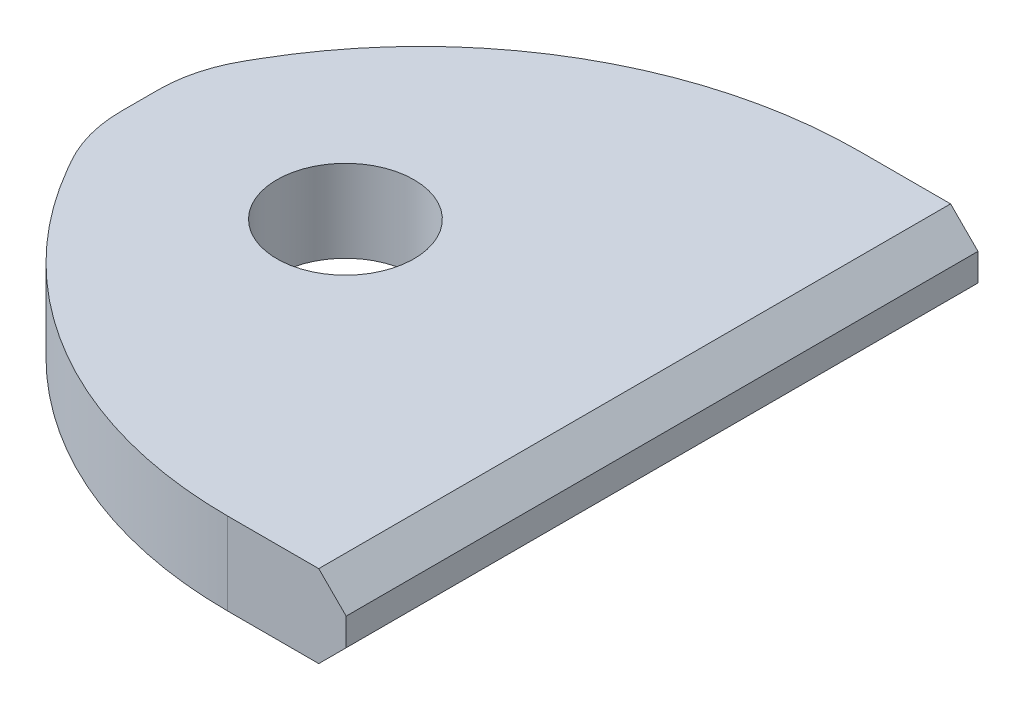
ISO-10303-21;
HEADER;
FILE_DESCRIPTION(('STEP AP214'),'2;1');
FILE_NAME('part.step','',(''),(''),'','','');
FILE_SCHEMA(('AUTOMOTIVE_DESIGN { 1 0 10303 214 1 1 1 1 }'));
ENDSEC;
DATA;
#1=APPLICATION_CONTEXT('core data for automotive mechanical design processes');
#2=APPLICATION_PROTOCOL_DEFINITION('international standard','automotive_design',2000,#1);
#3=PRODUCT_CONTEXT('',#1,'mechanical');
#4=PRODUCT('Part','Part','',(#3));
#5=PRODUCT_RELATED_PRODUCT_CATEGORY('part','',(#4));
#6=PRODUCT_DEFINITION_FORMATION('','',#4);
#7=PRODUCT_DEFINITION_CONTEXT('part definition',#1,'design');
#8=PRODUCT_DEFINITION('design','',#6,#7);
#9=PRODUCT_DEFINITION_SHAPE('','',#8);
#10=(LENGTH_UNIT() NAMED_UNIT(*) SI_UNIT(.MILLI.,.METRE.));
#11=(NAMED_UNIT(*) PLANE_ANGLE_UNIT() SI_UNIT($,.RADIAN.));
#12=(NAMED_UNIT(*) SI_UNIT($,.STERADIAN.) SOLID_ANGLE_UNIT());
#13=UNCERTAINTY_MEASURE_WITH_UNIT(LENGTH_MEASURE(1.E-05),#10,'distance_accuracy_value','');
#14=(GEOMETRIC_REPRESENTATION_CONTEXT(3) GLOBAL_UNCERTAINTY_ASSIGNED_CONTEXT((#13)) GLOBAL_UNIT_ASSIGNED_CONTEXT((#10,
#11,#12)) REPRESENTATION_CONTEXT('',''));
#15=CARTESIAN_POINT('',(0.,0.,0.));
#16=DIRECTION('',(0.,0.,1.));
#17=DIRECTION('',(1.,0.,0.));
#18=AXIS2_PLACEMENT_3D('',#15,#16,#17);
#19=CARTESIAN_POINT('',(22.9502505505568,4.7625,-14.224));
#20=DIRECTION('',(0.,-1.,0.));
#21=DIRECTION('',(0.,0.,-1.));
#22=AXIS2_PLACEMENT_3D('',#19,#20,#21);
#23=PLANE('',#22);
#24=DIRECTION('',(1.,0.,0.));
#25=VECTOR('',#24,1.);
#26=CARTESIAN_POINT('',(36.66109,4.7625,36.576));
#27=LINE('',#26,#25);
#28=CARTESIAN_POINT('',(22.9502505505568,4.7625,36.576));
#29=VERTEX_POINT('',#28);
#30=CARTESIAN_POINT('',(33.48609,4.7625,36.576));
#31=VERTEX_POINT('',#30);
#32=EDGE_CURVE('E193',#29,#31,#27,.T.);
#33=ORIENTED_EDGE('',*,*,#32,.T.);
#34=DIRECTION('',(0.,0.,-1.));
#35=VECTOR('',#34,1.);
#36=CARTESIAN_POINT('',(33.48609,4.7625,-14.224));
#37=LINE('',#36,#35);
#38=CARTESIAN_POINT('',(33.48609,4.7625,-36.576));
#39=VERTEX_POINT('',#38);
#40=EDGE_CURVE('E11',#31,#39,#37,.T.);
#41=ORIENTED_EDGE('',*,*,#40,.T.);
#42=DIRECTION('',(-1.,0.,0.));
#43=VECTOR('',#42,1.);
#44=CARTESIAN_POINT('',(22.9502505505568,4.7625,-36.576));
#45=LINE('',#44,#43);
#46=CARTESIAN_POINT('',(22.9502505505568,4.7625,-36.576));
#47=VERTEX_POINT('',#46);
#48=EDGE_CURVE('E128',#39,#47,#45,.T.);
#49=ORIENTED_EDGE('',*,*,#48,.T.);
#50=CARTESIAN_POINT('',(22.9502505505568,4.7625,14.224));
#51=DIRECTION('',(0.,1.,0.));
#52=DIRECTION('',(0.,0.,1.));
#53=AXIS2_PLACEMENT_3D('',#50,#51,#52);
#54=CIRCLE('',#53,50.8);
#55=CARTESIAN_POINT('',(-21.0438399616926,4.7625,-11.176));
#56=VERTEX_POINT('',#55);
#57=EDGE_CURVE('E131',#47,#56,#54,.T.);
#58=ORIENTED_EDGE('',*,*,#57,.T.);
#59=DIRECTION('',(-0.500000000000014,0.,0.86602540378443));
#60=VECTOR('',#59,1.);
#61=CARTESIAN_POINT('',(-21.6856532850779,4.7625,-10.0643467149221));
#62=LINE('',#61,#60);
#63=CARTESIAN_POINT('',(-21.6856532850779,4.7625,-10.0643467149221));
#64=VERTEX_POINT('',#63);
#65=EDGE_CURVE('E145',#56,#64,#62,.T.);
#66=ORIENTED_EDGE('',*,*,#65,.T.);
#67=CARTESIAN_POINT('',(-7.9375,4.7625,-2.12684671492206));
#68=DIRECTION('',(0.,1.,0.));
#69=DIRECTION('',(0.,0.,-1.));
#70=AXIS2_PLACEMENT_3D('',#67,#68,#69);
#71=CIRCLE('',#70,15.875);
#72=CARTESIAN_POINT('',(-23.8125,4.7625,-2.126846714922));
#73=VERTEX_POINT('',#72);
#74=EDGE_CURVE('E228',#64,#73,#71,.T.);
#75=ORIENTED_EDGE('',*,*,#74,.T.);
#76=DIRECTION('',(0.,0.,1.));
#77=VECTOR('',#76,1.);
#78=CARTESIAN_POINT('',(-23.8125,4.7625,2.12684671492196));
#79=LINE('',#78,#77);
#80=CARTESIAN_POINT('',(-23.8125,4.7625,2.12684671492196));
#81=VERTEX_POINT('',#80);
#82=EDGE_CURVE('E244',#73,#81,#79,.T.);
#83=ORIENTED_EDGE('',*,*,#82,.T.);
#84=CARTESIAN_POINT('',(-7.9375,4.7625,2.12684671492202));
#85=DIRECTION('',(0.,1.,0.));
#86=DIRECTION('',(0.,0.,1.));
#87=AXIS2_PLACEMENT_3D('',#84,#85,#86);
#88=CIRCLE('',#87,15.875);
#89=CARTESIAN_POINT('',(-21.685653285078,4.7625,10.064346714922));
#90=VERTEX_POINT('',#89);
#91=EDGE_CURVE('E241',#81,#90,#88,.T.);
#92=ORIENTED_EDGE('',*,*,#91,.T.);
#93=DIRECTION('',(0.500000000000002,0.,0.866025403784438));
#94=VECTOR('',#93,1.);
#95=CARTESIAN_POINT('',(-21.685653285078,4.7625,10.064346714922));
#96=LINE('',#95,#94);
#97=CARTESIAN_POINT('',(-21.0438399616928,4.7625,11.1759999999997));
#98=VERTEX_POINT('',#97);
#99=EDGE_CURVE('E243',#90,#98,#96,.T.);
#100=ORIENTED_EDGE('',*,*,#99,.T.);
#101=CARTESIAN_POINT('',(22.9502505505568,4.7625,-14.224));
#102=DIRECTION('',(0.,1.,0.));
#103=DIRECTION('',(0.,0.,-1.));
#104=AXIS2_PLACEMENT_3D('',#101,#102,#103);
#105=CIRCLE('',#104,50.8);
#106=EDGE_CURVE('E246',#98,#29,#105,.T.);
#107=ORIENTED_EDGE('',*,*,#106,.T.);
#108=EDGE_LOOP('',(#33,#41,#49,#58,#66,#75,#83,#92,#100,#107));
#109=FACE_BOUND('',#108,.T.);
#110=CARTESIAN_POINT('',(0.,4.7625,0.));
#111=DIRECTION('',(0.,1.,0.));
#112=DIRECTION('',(0.,0.,1.));
#113=AXIS2_PLACEMENT_3D('',#110,#111,#112);
#114=CIRCLE('',#113,7.9375);
#115=CARTESIAN_POINT('',(0.,4.7625,-7.9375));
#116=VERTEX_POINT('',#115);
#117=EDGE_CURVE('E185',#116,#116,#114,.T.);
#118=ORIENTED_EDGE('',*,*,#117,.F.);
#119=EDGE_LOOP('',(#118));
#120=FACE_BOUND('',#119,.T.);
#121=ADVANCED_FACE('F35',(#109,#120),#23,.F.);
#122=CARTESIAN_POINT('',(22.9502505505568,-4.7625,-14.224));
#123=DIRECTION('',(0.,-1.,0.));
#124=DIRECTION('',(0.,0.,-1.));
#125=AXIS2_PLACEMENT_3D('',#122,#123,#124);
#126=PLANE('',#125);
#127=DIRECTION('',(-1.,0.,0.));
#128=VECTOR('',#127,1.);
#129=CARTESIAN_POINT('',(22.9502505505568,-4.7625,-36.576));
#130=LINE('',#129,#128);
#131=CARTESIAN_POINT('',(33.48609,-4.7625,-36.576));
#132=VERTEX_POINT('',#131);
#133=CARTESIAN_POINT('',(22.9502505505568,-4.7625,-36.576));
#134=VERTEX_POINT('',#133);
#135=EDGE_CURVE('E149',#132,#134,#130,.T.);
#136=ORIENTED_EDGE('',*,*,#135,.F.);
#137=DIRECTION('',(0.,0.,1.));
#138=VECTOR('',#137,1.);
#139=CARTESIAN_POINT('',(33.48609,-4.7625,36.576));
#140=LINE('',#139,#138);
#141=CARTESIAN_POINT('',(33.48609,-4.7625,36.576));
#142=VERTEX_POINT('',#141);
#143=EDGE_CURVE('E59',#132,#142,#140,.T.);
#144=ORIENTED_EDGE('',*,*,#143,.T.);
#145=DIRECTION('',(1.,0.,0.));
#146=VECTOR('',#145,1.);
#147=CARTESIAN_POINT('',(36.66109,-4.7625,36.576));
#148=LINE('',#147,#146);
#149=CARTESIAN_POINT('',(22.9502505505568,-4.7625,36.576));
#150=VERTEX_POINT('',#149);
#151=EDGE_CURVE('E136',#150,#142,#148,.T.);
#152=ORIENTED_EDGE('',*,*,#151,.F.);
#153=CARTESIAN_POINT('',(22.9502505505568,-4.7625,-14.224));
#154=DIRECTION('',(0.,1.,0.));
#155=DIRECTION('',(0.,0.,-1.));
#156=AXIS2_PLACEMENT_3D('',#153,#154,#155);
#157=CIRCLE('',#156,50.8);
#158=CARTESIAN_POINT('',(-21.0438399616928,-4.7625,11.1759999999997));
#159=VERTEX_POINT('',#158);
#160=EDGE_CURVE('E205',#159,#150,#157,.T.);
#161=ORIENTED_EDGE('',*,*,#160,.F.);
#162=DIRECTION('',(0.500000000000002,0.,0.866025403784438));
#163=VECTOR('',#162,1.);
#164=CARTESIAN_POINT('',(-21.685653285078,-4.7625,10.064346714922));
#165=LINE('',#164,#163);
#166=CARTESIAN_POINT('',(-21.685653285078,-4.7625,10.064346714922));
#167=VERTEX_POINT('',#166);
#168=EDGE_CURVE('E203',#167,#159,#165,.T.);
#169=ORIENTED_EDGE('',*,*,#168,.F.);
#170=CARTESIAN_POINT('',(-7.9375,-4.7625,2.12684671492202));
#171=DIRECTION('',(0.,1.,0.));
#172=DIRECTION('',(0.,0.,1.));
#173=AXIS2_PLACEMENT_3D('',#170,#171,#172);
#174=CIRCLE('',#173,15.875);
#175=CARTESIAN_POINT('',(-23.8125,-4.7625,2.12684671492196));
#176=VERTEX_POINT('',#175);
#177=EDGE_CURVE('E201',#176,#167,#174,.T.);
#178=ORIENTED_EDGE('',*,*,#177,.F.);
#179=DIRECTION('',(0.,0.,1.));
#180=VECTOR('',#179,1.);
#181=CARTESIAN_POINT('',(-23.8125,-4.7625,2.12684671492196));
#182=LINE('',#181,#180);
#183=CARTESIAN_POINT('',(-23.8125,-4.7625,-2.126846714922));
#184=VERTEX_POINT('',#183);
#185=EDGE_CURVE('E199',#184,#176,#182,.T.);
#186=ORIENTED_EDGE('',*,*,#185,.F.);
#187=CARTESIAN_POINT('',(-7.9375,-4.7625,-2.12684671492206));
#188=DIRECTION('',(0.,1.,0.));
#189=DIRECTION('',(0.,0.,-1.));
#190=AXIS2_PLACEMENT_3D('',#187,#188,#189);
#191=CIRCLE('',#190,15.875);
#192=CARTESIAN_POINT('',(-21.6856532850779,-4.7625,-10.0643467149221));
#193=VERTEX_POINT('',#192);
#194=EDGE_CURVE('E197',#193,#184,#191,.T.);
#195=ORIENTED_EDGE('',*,*,#194,.F.);
#196=DIRECTION('',(-0.500000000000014,0.,0.86602540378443));
#197=VECTOR('',#196,1.);
#198=CARTESIAN_POINT('',(-21.6856532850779,-4.7625,-10.0643467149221));
#199=LINE('',#198,#197);
#200=CARTESIAN_POINT('',(-21.0438399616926,-4.7625,-11.176));
#201=VERTEX_POINT('',#200);
#202=EDGE_CURVE('E187',#201,#193,#199,.T.);
#203=ORIENTED_EDGE('',*,*,#202,.F.);
#204=CARTESIAN_POINT('',(22.9502505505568,-4.7625,14.224));
#205=DIRECTION('',(0.,1.,0.));
#206=DIRECTION('',(0.,0.,1.));
#207=AXIS2_PLACEMENT_3D('',#204,#205,#206);
#208=CIRCLE('',#207,50.8);
#209=EDGE_CURVE('E184',#134,#201,#208,.T.);
#210=ORIENTED_EDGE('',*,*,#209,.F.);
#211=EDGE_LOOP('',(#136,#144,#152,#161,#169,#178,#186,#195,#203,#210));
#212=FACE_BOUND('',#211,.T.);
#213=CARTESIAN_POINT('',(0.,-4.7625,0.));
#214=DIRECTION('',(0.,1.,0.));
#215=DIRECTION('',(0.,0.,1.));
#216=AXIS2_PLACEMENT_3D('',#213,#214,#215);
#217=CIRCLE('',#216,7.9375);
#218=CARTESIAN_POINT('',(0.,-4.7625,-7.9375));
#219=VERTEX_POINT('',#218);
#220=EDGE_CURVE('E190',#219,#219,#217,.T.);
#221=ORIENTED_EDGE('',*,*,#220,.T.);
#222=EDGE_LOOP('',(#221));
#223=FACE_BOUND('',#222,.T.);
#224=ADVANCED_FACE('F181',(#212,#223),#126,.T.);
#225=CARTESIAN_POINT('',(22.9502505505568,4.7625,-36.576));
#226=DIRECTION('',(0.,0.,1.));
#227=DIRECTION('',(1.,0.,0.));
#228=AXIS2_PLACEMENT_3D('',#225,#226,#227);
#229=PLANE('',#228);
#230=DIRECTION('',(0.,-1.,0.));
#231=VECTOR('',#230,1.);
#232=CARTESIAN_POINT('',(36.66109,4.7625,-36.576));
#233=LINE('',#232,#231);
#234=CARTESIAN_POINT('',(36.66109,1.58749999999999,-36.576));
#235=VERTEX_POINT('',#234);
#236=CARTESIAN_POINT('',(36.66109,-1.5875,-36.576));
#237=VERTEX_POINT('',#236);
#238=EDGE_CURVE('E178',#235,#237,#233,.T.);
#239=ORIENTED_EDGE('',*,*,#238,.T.);
#240=DIRECTION('',(-0.707106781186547,-0.707106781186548,0.));
#241=VECTOR('',#240,1.);
#242=CARTESIAN_POINT('',(36.66109,-1.5875,-36.576));
#243=LINE('',#242,#241);
#244=EDGE_CURVE('E163',#237,#132,#243,.T.);
#245=ORIENTED_EDGE('',*,*,#244,.T.);
#246=ORIENTED_EDGE('',*,*,#135,.T.);
#247=DIRECTION('',(0.,-1.,0.));
#248=VECTOR('',#247,1.);
#249=CARTESIAN_POINT('',(22.9502505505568,4.7625,-36.576));
#250=LINE('',#249,#248);
#251=EDGE_CURVE('E141',#47,#134,#250,.T.);
#252=ORIENTED_EDGE('',*,*,#251,.F.);
#253=ORIENTED_EDGE('',*,*,#48,.F.);
#254=DIRECTION('',(-0.707106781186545,0.70710678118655,0.));
#255=VECTOR('',#254,1.);
#256=CARTESIAN_POINT('',(33.48609,4.7625,-36.576));
#257=LINE('',#256,#255);
#258=EDGE_CURVE('E161',#39,#235,#257,.F.);
#259=ORIENTED_EDGE('',*,*,#258,.T.);
#260=EDGE_LOOP('',(#239,#245,#246,#252,#253,#259));
#261=FACE_BOUND('',#260,.T.);
#262=ADVANCED_FACE('F148',(#261),#229,.F.);
#263=CARTESIAN_POINT('',(22.9502505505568,4.7625,14.224));
#264=DIRECTION('',(0.,-1.,0.));
#265=DIRECTION('',(0.,0.,-1.));
#266=AXIS2_PLACEMENT_3D('',#263,#264,#265);
#267=CYLINDRICAL_SURFACE('',#266,50.8);
#268=ORIENTED_EDGE('',*,*,#209,.T.);
#269=DIRECTION('',(0.,-1.,0.));
#270=VECTOR('',#269,1.);
#271=CARTESIAN_POINT('',(-21.0438399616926,4.7625,-11.176));
#272=LINE('',#271,#270);
#273=EDGE_CURVE('E143',#56,#201,#272,.T.);
#274=ORIENTED_EDGE('',*,*,#273,.F.);
#275=ORIENTED_EDGE('',*,*,#57,.F.);
#276=ORIENTED_EDGE('',*,*,#251,.T.);
#277=EDGE_LOOP('',(#268,#274,#275,#276));
#278=FACE_BOUND('',#277,.T.);
#279=ADVANCED_FACE('F140',(#278),#267,.T.);
#280=CARTESIAN_POINT('',(-21.6856532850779,4.7625,-10.0643467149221));
#281=DIRECTION('',(0.86602540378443,0.,0.500000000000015));
#282=DIRECTION('',(0.500000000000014,0.,-0.86602540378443));
#283=AXIS2_PLACEMENT_3D('',#280,#281,#282);
#284=PLANE('',#283);
#285=ORIENTED_EDGE('',*,*,#202,.T.);
#286=DIRECTION('',(0.,-1.,0.));
#287=VECTOR('',#286,1.);
#288=CARTESIAN_POINT('',(-21.6856532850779,4.7625,-10.0643467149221));
#289=LINE('',#288,#287);
#290=EDGE_CURVE('E155',#64,#193,#289,.T.);
#291=ORIENTED_EDGE('',*,*,#290,.F.);
#292=ORIENTED_EDGE('',*,*,#65,.F.);
#293=ORIENTED_EDGE('',*,*,#273,.T.);
#294=EDGE_LOOP('',(#285,#291,#292,#293));
#295=FACE_BOUND('',#294,.T.);
#296=ADVANCED_FACE('F284',(#295),#284,.F.);
#297=CARTESIAN_POINT('',(-7.9375,4.7625,-2.12684671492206));
#298=DIRECTION('',(0.,-1.,0.));
#299=DIRECTION('',(0.,0.,-1.));
#300=AXIS2_PLACEMENT_3D('',#297,#298,#299);
#301=CYLINDRICAL_SURFACE('',#300,15.875);
#302=ORIENTED_EDGE('',*,*,#194,.T.);
#303=DIRECTION('',(0.,-1.,0.));
#304=VECTOR('',#303,1.);
#305=CARTESIAN_POINT('',(-23.8125,4.7625,-2.126846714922));
#306=LINE('',#305,#304);
#307=EDGE_CURVE('E219',#73,#184,#306,.T.);
#308=ORIENTED_EDGE('',*,*,#307,.F.);
#309=ORIENTED_EDGE('',*,*,#74,.F.);
#310=ORIENTED_EDGE('',*,*,#290,.T.);
#311=EDGE_LOOP('',(#302,#308,#309,#310));
#312=FACE_BOUND('',#311,.T.);
#313=ADVANCED_FACE('F226',(#312),#301,.T.);
#314=CARTESIAN_POINT('',(-23.8125,4.7625,2.12684671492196));
#315=DIRECTION('',(1.,0.,0.));
#316=DIRECTION('',(0.,0.,-1.));
#317=AXIS2_PLACEMENT_3D('',#314,#315,#316);
#318=PLANE('',#317);
#319=ORIENTED_EDGE('',*,*,#185,.T.);
#320=DIRECTION('',(0.,-1.,0.));
#321=VECTOR('',#320,1.);
#322=CARTESIAN_POINT('',(-23.8125,4.7625,2.12684671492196));
#323=LINE('',#322,#321);
#324=EDGE_CURVE('E216',#81,#176,#323,.T.);
#325=ORIENTED_EDGE('',*,*,#324,.F.);
#326=ORIENTED_EDGE('',*,*,#82,.F.);
#327=ORIENTED_EDGE('',*,*,#307,.T.);
#328=EDGE_LOOP('',(#319,#325,#326,#327));
#329=FACE_BOUND('',#328,.T.);
#330=ADVANCED_FACE('F235',(#329),#318,.F.);
#331=CARTESIAN_POINT('',(-7.9375,4.7625,2.12684671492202));
#332=DIRECTION('',(0.,-1.,0.));
#333=DIRECTION('',(0.,0.,-1.));
#334=AXIS2_PLACEMENT_3D('',#331,#332,#333);
#335=CYLINDRICAL_SURFACE('',#334,15.875);
#336=ORIENTED_EDGE('',*,*,#177,.T.);
#337=DIRECTION('',(0.,-1.,0.));
#338=VECTOR('',#337,1.);
#339=CARTESIAN_POINT('',(-21.685653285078,4.7625,10.064346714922));
#340=LINE('',#339,#338);
#341=EDGE_CURVE('E213',#90,#167,#340,.T.);
#342=ORIENTED_EDGE('',*,*,#341,.F.);
#343=ORIENTED_EDGE('',*,*,#91,.F.);
#344=ORIENTED_EDGE('',*,*,#324,.T.);
#345=EDGE_LOOP('',(#336,#342,#343,#344));
#346=FACE_BOUND('',#345,.T.);
#347=ADVANCED_FACE('F239',(#346),#335,.T.);
#348=CARTESIAN_POINT('',(-21.685653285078,4.7625,10.064346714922));
#349=DIRECTION('',(0.866025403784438,0.,-0.500000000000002));
#350=DIRECTION('',(-0.500000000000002,0.,-0.866025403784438));
#351=AXIS2_PLACEMENT_3D('',#348,#349,#350);
#352=PLANE('',#351);
#353=ORIENTED_EDGE('',*,*,#168,.T.);
#354=DIRECTION('',(0.,-1.,0.));
#355=VECTOR('',#354,1.);
#356=CARTESIAN_POINT('',(-21.0438399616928,4.7625,11.1759999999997));
#357=LINE('',#356,#355);
#358=EDGE_CURVE('E210',#98,#159,#357,.T.);
#359=ORIENTED_EDGE('',*,*,#358,.F.);
#360=ORIENTED_EDGE('',*,*,#99,.F.);
#361=ORIENTED_EDGE('',*,*,#341,.T.);
#362=EDGE_LOOP('',(#353,#359,#360,#361));
#363=FACE_BOUND('',#362,.T.);
#364=ADVANCED_FACE('F273',(#363),#352,.F.);
#365=CARTESIAN_POINT('',(22.9502505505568,4.7625,-14.224));
#366=DIRECTION('',(0.,-1.,0.));
#367=DIRECTION('',(0.,0.,-1.));
#368=AXIS2_PLACEMENT_3D('',#365,#366,#367);
#369=CYLINDRICAL_SURFACE('',#368,50.8);
#370=ORIENTED_EDGE('',*,*,#160,.T.);
#371=DIRECTION('',(0.,-1.,0.));
#372=VECTOR('',#371,1.);
#373=CARTESIAN_POINT('',(22.9502505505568,4.7625,36.576));
#374=LINE('',#373,#372);
#375=EDGE_CURVE('E177',#29,#150,#374,.T.);
#376=ORIENTED_EDGE('',*,*,#375,.F.);
#377=ORIENTED_EDGE('',*,*,#106,.F.);
#378=ORIENTED_EDGE('',*,*,#358,.T.);
#379=EDGE_LOOP('',(#370,#376,#377,#378));
#380=FACE_BOUND('',#379,.T.);
#381=ADVANCED_FACE('F270',(#380),#369,.T.);
#382=CARTESIAN_POINT('',(36.66109,4.7625,36.576));
#383=DIRECTION('',(0.,0.,-1.));
#384=DIRECTION('',(-1.,0.,0.));
#385=AXIS2_PLACEMENT_3D('',#382,#383,#384);
#386=PLANE('',#385);
#387=ORIENTED_EDGE('',*,*,#151,.T.);
#388=DIRECTION('',(0.707106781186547,0.707106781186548,0.));
#389=VECTOR('',#388,1.);
#390=CARTESIAN_POINT('',(36.66109,-1.58750000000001,36.576));
#391=LINE('',#390,#389);
#392=CARTESIAN_POINT('',(36.66109,-1.5875,36.576));
#393=VERTEX_POINT('',#392);
#394=EDGE_CURVE('E44',#142,#393,#391,.T.);
#395=ORIENTED_EDGE('',*,*,#394,.T.);
#396=DIRECTION('',(0.,-1.,0.));
#397=VECTOR('',#396,1.);
#398=CARTESIAN_POINT('',(36.66109,4.7625,36.576));
#399=LINE('',#398,#397);
#400=CARTESIAN_POINT('',(36.66109,1.58749999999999,36.576));
#401=VERTEX_POINT('',#400);
#402=EDGE_CURVE('E169',#401,#393,#399,.T.);
#403=ORIENTED_EDGE('',*,*,#402,.F.);
#404=DIRECTION('',(0.707106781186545,-0.70710678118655,0.));
#405=VECTOR('',#404,1.);
#406=CARTESIAN_POINT('',(33.48609,4.7625,36.576));
#407=LINE('',#406,#405);
#408=EDGE_CURVE('E51',#401,#31,#407,.F.);
#409=ORIENTED_EDGE('',*,*,#408,.T.);
#410=ORIENTED_EDGE('',*,*,#32,.F.);
#411=ORIENTED_EDGE('',*,*,#375,.T.);
#412=EDGE_LOOP('',(#387,#395,#403,#409,#410,#411));
#413=FACE_BOUND('',#412,.T.);
#414=ADVANCED_FACE('F168',(#413),#386,.F.);
#415=CARTESIAN_POINT('',(36.66109,4.7625,-36.576));
#416=DIRECTION('',(-1.,0.,0.));
#417=DIRECTION('',(0.,0.,1.));
#418=AXIS2_PLACEMENT_3D('',#415,#416,#417);
#419=PLANE('',#418);
#420=ORIENTED_EDGE('',*,*,#402,.T.);
#421=DIRECTION('',(0.,0.,-1.));
#422=VECTOR('',#421,1.);
#423=CARTESIAN_POINT('',(36.66109,-1.5875,-36.576));
#424=LINE('',#423,#422);
#425=EDGE_CURVE('E153',#393,#237,#424,.T.);
#426=ORIENTED_EDGE('',*,*,#425,.T.);
#427=ORIENTED_EDGE('',*,*,#238,.F.);
#428=DIRECTION('',(0.,0.,1.));
#429=VECTOR('',#428,1.);
#430=CARTESIAN_POINT('',(36.66109,1.58749999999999,-36.576));
#431=LINE('',#430,#429);
#432=EDGE_CURVE('E151',#235,#401,#431,.T.);
#433=ORIENTED_EDGE('',*,*,#432,.T.);
#434=EDGE_LOOP('',(#420,#426,#427,#433));
#435=FACE_BOUND('',#434,.T.);
#436=ADVANCED_FACE('F174',(#435),#419,.F.);
#437=CARTESIAN_POINT('',(0.,4.7625,0.));
#438=DIRECTION('',(0.,-1.,0.));
#439=DIRECTION('',(0.,0.,-1.));
#440=AXIS2_PLACEMENT_3D('',#437,#438,#439);
#441=CYLINDRICAL_SURFACE('',#440,7.9375);
#442=CARTESIAN_POINT('',(0.,4.7625,-7.9375));
#443=CARTESIAN_POINT('',(0.,4.66328125,-7.9375));
#444=CARTESIAN_POINT('',(0.,4.5640625,-7.9375));
#445=CARTESIAN_POINT('',(0.,4.365625,-7.9375));
#446=CARTESIAN_POINT('',(0.,4.26640625,-7.9375));
#447=CARTESIAN_POINT('',(0.,4.06796875,-7.9375));
#448=CARTESIAN_POINT('',(0.,3.96875,-7.9375));
#449=CARTESIAN_POINT('',(0.,3.7703125,-7.9375));
#450=CARTESIAN_POINT('',(0.,3.67109375,-7.9375));
#451=CARTESIAN_POINT('',(0.,3.47265625,-7.9375));
#452=CARTESIAN_POINT('',(0.,3.3734375,-7.9375));
#453=CARTESIAN_POINT('',(0.,3.175,-7.9375));
#454=CARTESIAN_POINT('',(0.,3.07578125,-7.9375));
#455=CARTESIAN_POINT('',(0.,2.87734375,-7.9375));
#456=CARTESIAN_POINT('',(0.,2.778125,-7.9375));
#457=CARTESIAN_POINT('',(0.,2.5796875,-7.9375));
#458=CARTESIAN_POINT('',(0.,2.48046875,-7.9375));
#459=CARTESIAN_POINT('',(0.,2.28203125,-7.9375));
#460=CARTESIAN_POINT('',(0.,2.1828125,-7.9375));
#461=CARTESIAN_POINT('',(0.,1.984375,-7.9375));
#462=CARTESIAN_POINT('',(0.,1.88515625,-7.9375));
#463=CARTESIAN_POINT('',(0.,1.68671875,-7.9375));
#464=CARTESIAN_POINT('',(0.,1.5875,-7.9375));
#465=CARTESIAN_POINT('',(0.,1.3890625,-7.9375));
#466=CARTESIAN_POINT('',(0.,1.28984375,-7.9375));
#467=CARTESIAN_POINT('',(0.,1.09140625,-7.9375));
#468=CARTESIAN_POINT('',(0.,0.992187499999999,-7.9375));
#469=CARTESIAN_POINT('',(0.,0.79375,-7.9375));
#470=CARTESIAN_POINT('',(0.,0.69453125,-7.9375));
#471=CARTESIAN_POINT('',(0.,0.49609375,-7.9375));
#472=CARTESIAN_POINT('',(0.,0.396875,-7.9375));
#473=CARTESIAN_POINT('',(0.,0.1984375,-7.9375));
#474=CARTESIAN_POINT('',(0.,0.0992187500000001,-7.9375));
#475=CARTESIAN_POINT('',(0.,-0.0992187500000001,-7.9375));
#476=CARTESIAN_POINT('',(0.,-0.1984375,-7.9375));
#477=CARTESIAN_POINT('',(0.,-0.396875,-7.9375));
#478=CARTESIAN_POINT('',(0.,-0.49609375,-7.9375));
#479=CARTESIAN_POINT('',(0.,-0.69453125,-7.9375));
#480=CARTESIAN_POINT('',(0.,-0.793750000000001,-7.9375));
#481=CARTESIAN_POINT('',(0.,-0.992187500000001,-7.9375));
#482=CARTESIAN_POINT('',(0.,-1.09140625,-7.9375));
#483=CARTESIAN_POINT('',(0.,-1.28984375,-7.9375));
#484=CARTESIAN_POINT('',(0.,-1.3890625,-7.9375));
#485=CARTESIAN_POINT('',(0.,-1.5875,-7.9375));
#486=CARTESIAN_POINT('',(0.,-1.68671875,-7.9375));
#487=CARTESIAN_POINT('',(0.,-1.88515625,-7.9375));
#488=CARTESIAN_POINT('',(0.,-1.984375,-7.9375));
#489=CARTESIAN_POINT('',(0.,-2.1828125,-7.9375));
#490=CARTESIAN_POINT('',(0.,-2.28203125,-7.9375));
#491=CARTESIAN_POINT('',(0.,-2.48046875,-7.9375));
#492=CARTESIAN_POINT('',(0.,-2.5796875,-7.9375));
#493=CARTESIAN_POINT('',(0.,-2.778125,-7.9375));
#494=CARTESIAN_POINT('',(0.,-2.87734375,-7.9375));
#495=CARTESIAN_POINT('',(0.,-3.07578125,-7.9375));
#496=CARTESIAN_POINT('',(0.,-3.175,-7.9375));
#497=CARTESIAN_POINT('',(0.,-3.3734375,-7.9375));
#498=CARTESIAN_POINT('',(0.,-3.47265625,-7.9375));
#499=CARTESIAN_POINT('',(0.,-3.67109375,-7.9375));
#500=CARTESIAN_POINT('',(0.,-3.7703125,-7.9375));
#501=CARTESIAN_POINT('',(0.,-3.96875,-7.9375));
#502=CARTESIAN_POINT('',(0.,-4.06796875,-7.9375));
#503=CARTESIAN_POINT('',(0.,-4.26640625,-7.9375));
#504=CARTESIAN_POINT('',(0.,-4.365625,-7.9375));
#505=CARTESIAN_POINT('',(0.,-4.5640625,-7.9375));
#506=CARTESIAN_POINT('',(0.,-4.66328125,-7.9375));
#507=CARTESIAN_POINT('',(0.,-4.7625,-7.9375));
#508=B_SPLINE_CURVE_WITH_KNOTS('',3,(#442,#443,#444,#445,#446,#447,#448,#449,#450,#451,#452,
#453,#454,#455,#456,#457,#458,#459,#460,#461,#462,#463,#464,#465,#466,#467,#468,#469,#470,#471,
#472,#473,#474,#475,#476,#477,#478,#479,#480,#481,#482,#483,#484,#485,#486,#487,#488,#489,#490,
#491,#492,#493,#494,#495,#496,#497,#498,#499,#500,#501,#502,#503,#504,#505,#506,#507),
.UNSPECIFIED.,.F.,.F.,(4,2,2,2,2,2,2,2,2,2,2,2,2,2,2,2,2,2,2,2,2,2,2,2,2,2,2,2,2,2,2,2,4),(0.,
0.29765625,0.5953125,0.892968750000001,1.190625,1.48828125,1.7859375,2.08359375,2.38125,
2.67890625,2.9765625,3.27421875,3.571875,3.86953125,4.1671875,4.46484375,4.7625,5.06015625,
5.3578125,5.65546875,5.953125,6.25078125,6.5484375,6.84609375,7.14375,7.44140625,7.7390625,
8.03671875,8.334375,8.63203125,8.9296875,9.22734375,9.525),.UNSPECIFIED.);
#509=EDGE_CURVE('BSEAM257',#116,#219,#508,.T.);
#510=ORIENTED_EDGE('',*,*,#117,.T.);
#511=ORIENTED_EDGE('',*,*,#220,.F.);
#512=ORIENTED_EDGE('',*,*,#509,.T.);
#513=ORIENTED_EDGE('',*,*,#509,.F.);
#514=EDGE_LOOP('',(#510,#512,#511,#513));
#515=FACE_BOUND('',#514,.T.);
#516=ADVANCED_FACE('F257',(#515),#441,.F.);
#517=CARTESIAN_POINT('',(36.66109,-1.5875,-36.576));
#518=DIRECTION('',(0.707106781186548,-0.707106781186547,0.));
#519=DIRECTION('',(0.,0.,1.));
#520=AXIS2_PLACEMENT_3D('',#517,#518,#519);
#521=PLANE('',#520);
#522=ORIENTED_EDGE('',*,*,#394,.F.);
#523=ORIENTED_EDGE('',*,*,#143,.F.);
#524=ORIENTED_EDGE('',*,*,#244,.F.);
#525=ORIENTED_EDGE('',*,*,#425,.F.);
#526=EDGE_LOOP('',(#522,#523,#524,#525));
#527=FACE_BOUND('',#526,.T.);
#528=ADVANCED_FACE('F180',(#527),#521,.T.);
#529=CARTESIAN_POINT('',(33.48609,4.7625,-14.224));
#530=DIRECTION('',(-0.70710678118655,-0.707106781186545,0.));
#531=DIRECTION('',(0.,0.,-1.));
#532=AXIS2_PLACEMENT_3D('',#529,#530,#531);
#533=PLANE('',#532);
#534=ORIENTED_EDGE('',*,*,#408,.F.);
#535=ORIENTED_EDGE('',*,*,#432,.F.);
#536=ORIENTED_EDGE('',*,*,#258,.F.);
#537=ORIENTED_EDGE('',*,*,#40,.F.);
#538=EDGE_LOOP('',(#534,#535,#536,#537));
#539=FACE_BOUND('',#538,.T.);
#540=ADVANCED_FACE('F38',(#539),#533,.F.);
#541=CLOSED_SHELL('',(#121,#224,#262,#279,#296,#313,#330,#347,#364,#381,#414,#436,#516,#528,#540));
#542=MANIFOLD_SOLID_BREP('B2',#541);
#543=ADVANCED_BREP_SHAPE_REPRESENTATION('',(#18,#542),#14);
#544=SHAPE_DEFINITION_REPRESENTATION(#9,#543);
ENDSEC;
END-ISO-10303-21;
